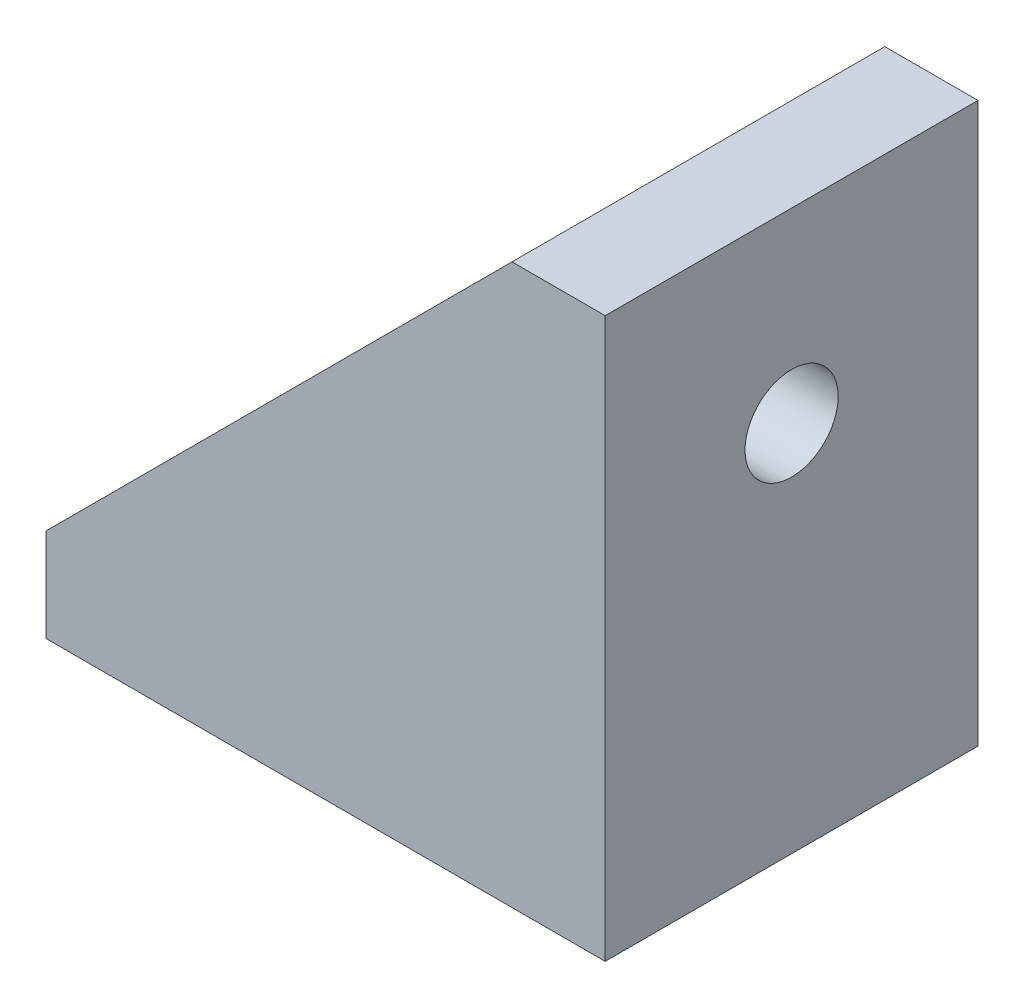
from build123d import *

# Parameters (mm, degrees)
SKETCH_1_W          = 5
SKETCH_1_H          = 25
SKETCH_1_W_2        = 25
SKETCH_1_H_2        = 5
EXTRUDE_1_DEPTH     = 20
SKETCH_2_W          = 16
SKETCH_2_H          = 25
CUT_EXTRUDE_1_DEPTH = 25
SKETCH_3_R          = 2.5
CUT_EXTRUDE_2_DEPTH = 44.874821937
SKETCH_4_R          = 2.5
CUT_EXTRUDE_3_DEPTH = 44.874821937


with BuildPart() as part:
    # Sketch 1 → Extrude 1 (new body)
    with BuildSketch(Plane.XY):
        Polygon((-5, 5), (-5, 30), (-30, 5), align=None)
        with Locations((-2.5, 17.5)):
            Rectangle(SKETCH_1_W, SKETCH_1_H)
        with Locations((-17.5, 2.5)):
            Rectangle(SKETCH_1_W_2, SKETCH_1_H_2)
        with Locations((-2.5, 2.5)):
            Rectangle(SKETCH_1_W, SKETCH_1_H_2)
    extrude(amount=EXTRUDE_1_DEPTH)

    # Sketch 2 → Cut-Extrude 1 (cut)
    with BuildSketch(Plane.ZY.offset(30)):
        with Locations((10, 17.5)):
            Rectangle(SKETCH_2_W, SKETCH_2_H)
    extrude(amount=-CUT_EXTRUDE_1_DEPTH, mode=Mode.SUBTRACT)

    # Sketch 3 → Cut-Extrude 2 (cut, through all)
    with BuildSketch(Plane.ZY.offset(5)):
        with Locations((10, 20)):
            Circle(SKETCH_3_R)
    extrude(amount=-CUT_EXTRUDE_2_DEPTH, mode=Mode.SUBTRACT)

    # Sketch 4 → Cut-Extrude 3 (cut, through all)
    with BuildSketch(Plane(origin=(0, 5, 0), x_dir=(1, 0, 0), z_dir=(0, 1, 0))):
        with Locations(Location((-20, -10, 0), (0, 0, 270))):
            Circle(SKETCH_4_R)
    extrude(amount=-CUT_EXTRUDE_3_DEPTH, mode=Mode.SUBTRACT)


solid = part.part
